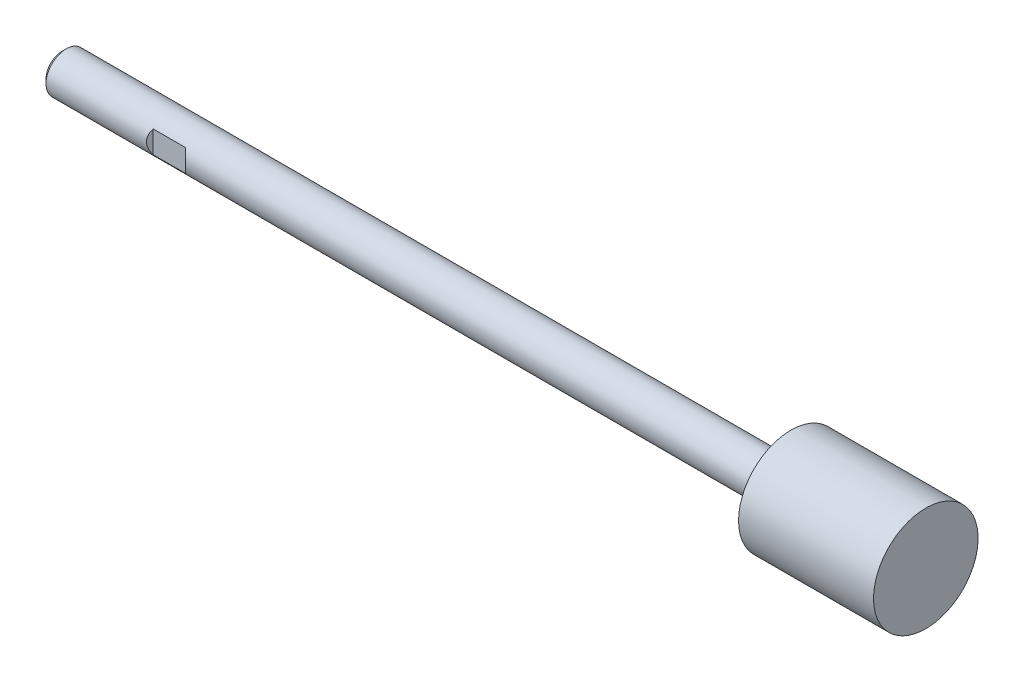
ISO-10303-21;
HEADER;
FILE_DESCRIPTION(('STEP AP214'),'2;1');
FILE_NAME('part.step','',(''),(''),'','','');
FILE_SCHEMA(('AUTOMOTIVE_DESIGN { 1 0 10303 214 1 1 1 1 }'));
ENDSEC;
DATA;
#1=APPLICATION_CONTEXT('core data for automotive mechanical design processes');
#2=APPLICATION_PROTOCOL_DEFINITION('international standard','automotive_design',2000,#1);
#3=PRODUCT_CONTEXT('',#1,'mechanical');
#4=PRODUCT('Part','Part','',(#3));
#5=PRODUCT_RELATED_PRODUCT_CATEGORY('part','',(#4));
#6=PRODUCT_DEFINITION_FORMATION('','',#4);
#7=PRODUCT_DEFINITION_CONTEXT('part definition',#1,'design');
#8=PRODUCT_DEFINITION('design','',#6,#7);
#9=PRODUCT_DEFINITION_SHAPE('','',#8);
#10=(LENGTH_UNIT() NAMED_UNIT(*) SI_UNIT(.MILLI.,.METRE.));
#11=(NAMED_UNIT(*) PLANE_ANGLE_UNIT() SI_UNIT($,.RADIAN.));
#12=(NAMED_UNIT(*) SI_UNIT($,.STERADIAN.) SOLID_ANGLE_UNIT());
#13=UNCERTAINTY_MEASURE_WITH_UNIT(LENGTH_MEASURE(1.E-05),#10,'distance_accuracy_value','');
#14=(GEOMETRIC_REPRESENTATION_CONTEXT(3) GLOBAL_UNCERTAINTY_ASSIGNED_CONTEXT((#13)) GLOBAL_UNIT_ASSIGNED_CONTEXT((#10,
#11,#12)) REPRESENTATION_CONTEXT('',''));
#15=CARTESIAN_POINT('',(0.,0.,0.));
#16=DIRECTION('',(0.,0.,1.));
#17=DIRECTION('',(1.,0.,0.));
#18=AXIS2_PLACEMENT_3D('',#15,#16,#17);
#19=CARTESIAN_POINT('',(0.,0.,0.));
#20=DIRECTION('',(1.,0.,0.));
#21=DIRECTION('',(0.,0.,-1.));
#22=AXIS2_PLACEMENT_3D('',#19,#20,#21);
#23=PLANE('',#22);
#24=CARTESIAN_POINT('',(0.,0.,0.));
#25=DIRECTION('',(-1.,0.,0.));
#26=DIRECTION('',(0.,0.,1.));
#27=AXIS2_PLACEMENT_3D('',#24,#25,#26);
#28=CIRCLE('',#27,2.3865);
#29=CARTESIAN_POINT('',(0.,0.,2.3865));
#30=VERTEX_POINT('',#29);
#31=EDGE_CURVE('E60',#30,#30,#28,.T.);
#32=ORIENTED_EDGE('',*,*,#31,.T.);
#33=EDGE_LOOP('',(#32));
#34=FACE_BOUND('',#33,.T.);
#35=ADVANCED_FACE('F16',(#34),#23,.F.);
#36=CARTESIAN_POINT('',(0.613499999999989,0.,0.));
#37=DIRECTION('',(1.,0.,0.));
#38=DIRECTION('',(0.,0.,-1.));
#39=AXIS2_PLACEMENT_3D('',#36,#37,#38);
#40=CONICAL_SURFACE('',#39,3.,0.785398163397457);
#41=ORIENTED_EDGE('',*,*,#31,.F.);
#42=EDGE_LOOP('',(#41));
#43=FACE_BOUND('',#42,.T.);
#44=CARTESIAN_POINT('',(0.613499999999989,0.,0.));
#45=DIRECTION('',(-1.,0.,0.));
#46=DIRECTION('',(0.,0.,1.));
#47=AXIS2_PLACEMENT_3D('',#44,#45,#46);
#48=CIRCLE('',#47,3.);
#49=CARTESIAN_POINT('',(0.613499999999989,0.,3.));
#50=VERTEX_POINT('',#49);
#51=EDGE_CURVE('E105',#50,#50,#48,.T.);
#52=ORIENTED_EDGE('',*,*,#51,.T.);
#53=EDGE_LOOP('',(#52));
#54=FACE_BOUND('',#53,.T.);
#55=ADVANCED_FACE('F111',(#43,#54),#40,.T.);
#56=CARTESIAN_POINT('',(128.,0.,0.));
#57=DIRECTION('',(-1.,0.,0.));
#58=DIRECTION('',(0.,0.,1.));
#59=AXIS2_PLACEMENT_3D('',#56,#57,#58);
#60=CYLINDRICAL_SURFACE('',#59,3.);
#61=DIRECTION('',(-1.,0.,0.));
#62=VECTOR('',#61,1.);
#63=CARTESIAN_POINT('',(128.,-1.6583123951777,-2.5));
#64=LINE('',#63,#62);
#65=CARTESIAN_POINT('',(16.,-1.65831239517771,-2.5));
#66=VERTEX_POINT('',#65);
#67=CARTESIAN_POINT('',(20.8,-1.6583123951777,-2.5));
#68=VERTEX_POINT('',#67);
#69=EDGE_CURVE('E81',#66,#68,#64,.F.);
#70=ORIENTED_EDGE('',*,*,#69,.T.);
#71=CARTESIAN_POINT('',(18.3,0.,0.));
#72=DIRECTION('',(0.707106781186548,0.,0.707106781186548));
#73=DIRECTION('',(-0.707106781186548,0.,0.707106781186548));
#74=AXIS2_PLACEMENT_3D('',#71,#72,#73);
#75=ELLIPSE('',#74,4.24264068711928,3.);
#76=CARTESIAN_POINT('',(20.8,1.6583123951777,-2.5));
#77=VERTEX_POINT('',#76);
#78=EDGE_CURVE('E11',#68,#77,#75,.T.);
#79=ORIENTED_EDGE('',*,*,#78,.T.);
#80=DIRECTION('',(-1.,0.,0.));
#81=VECTOR('',#80,1.);
#82=CARTESIAN_POINT('',(128.,1.6583123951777,-2.5));
#83=LINE('',#82,#81);
#84=CARTESIAN_POINT('',(16.,1.65831239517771,-2.5));
#85=VERTEX_POINT('',#84);
#86=EDGE_CURVE('E23',#77,#85,#83,.T.);
#87=ORIENTED_EDGE('',*,*,#86,.T.);
#88=CARTESIAN_POINT('',(18.5,0.,0.));
#89=DIRECTION('',(-0.707106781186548,0.,0.707106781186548));
#90=DIRECTION('',(-0.707106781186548,0.,-0.707106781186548));
#91=AXIS2_PLACEMENT_3D('',#88,#89,#90);
#92=ELLIPSE('',#91,4.24264068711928,3.);
#93=EDGE_CURVE('E78',#85,#66,#92,.T.);
#94=ORIENTED_EDGE('',*,*,#93,.T.);
#95=EDGE_LOOP('',(#70,#79,#87,#94));
#96=FACE_BOUND('',#95,.T.);
#97=DIRECTION('',(-1.,0.,0.));
#98=VECTOR('',#97,1.);
#99=CARTESIAN_POINT('',(128.,-1.6583123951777,2.5));
#100=LINE('',#99,#98);
#101=CARTESIAN_POINT('',(20.8,-1.65831239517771,2.5));
#102=VERTEX_POINT('',#101);
#103=CARTESIAN_POINT('',(16.,-1.6583123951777,2.5));
#104=VERTEX_POINT('',#103);
#105=EDGE_CURVE('E66',#102,#104,#100,.T.);
#106=ORIENTED_EDGE('',*,*,#105,.T.);
#107=CARTESIAN_POINT('',(18.5,0.,0.));
#108=DIRECTION('',(-0.707106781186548,0.,-0.707106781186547));
#109=DIRECTION('',(-0.707106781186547,0.,0.707106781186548));
#110=AXIS2_PLACEMENT_3D('',#107,#108,#109);
#111=ELLIPSE('',#110,4.24264068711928,3.);
#112=CARTESIAN_POINT('',(16.,1.6583123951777,2.5));
#113=VERTEX_POINT('',#112);
#114=EDGE_CURVE('E72',#104,#113,#111,.T.);
#115=ORIENTED_EDGE('',*,*,#114,.T.);
#116=DIRECTION('',(-1.,0.,0.));
#117=VECTOR('',#116,1.);
#118=CARTESIAN_POINT('',(128.,1.6583123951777,2.5));
#119=LINE('',#118,#117);
#120=CARTESIAN_POINT('',(20.8,1.65831239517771,2.5));
#121=VERTEX_POINT('',#120);
#122=EDGE_CURVE('E59',#113,#121,#119,.F.);
#123=ORIENTED_EDGE('',*,*,#122,.T.);
#124=CARTESIAN_POINT('',(18.3,0.,0.));
#125=DIRECTION('',(0.707106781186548,0.,-0.707106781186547));
#126=DIRECTION('',(-0.707106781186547,0.,-0.707106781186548));
#127=AXIS2_PLACEMENT_3D('',#124,#125,#126);
#128=ELLIPSE('',#127,4.24264068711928,3.);
#129=EDGE_CURVE('E54',#121,#102,#128,.T.);
#130=ORIENTED_EDGE('',*,*,#129,.T.);
#131=EDGE_LOOP('',(#106,#115,#123,#130));
#132=FACE_BOUND('',#131,.T.);
#133=ORIENTED_EDGE('',*,*,#51,.F.);
#134=EDGE_LOOP('',(#133));
#135=FACE_BOUND('',#134,.T.);
#136=CARTESIAN_POINT('',(108.,0.,0.));
#137=DIRECTION('',(-1.,0.,0.));
#138=DIRECTION('',(0.,0.,1.));
#139=AXIS2_PLACEMENT_3D('',#136,#137,#138);
#140=CIRCLE('',#139,3.);
#141=CARTESIAN_POINT('',(108.,0.,3.));
#142=VERTEX_POINT('',#141);
#143=EDGE_CURVE('E102',#142,#142,#140,.T.);
#144=ORIENTED_EDGE('',*,*,#143,.T.);
#145=EDGE_LOOP('',(#144));
#146=FACE_BOUND('',#145,.T.);
#147=ADVANCED_FACE('F70',(#96,#132,#135,#146),#60,.T.);
#148=CARTESIAN_POINT('',(108.,3.,0.));
#149=DIRECTION('',(1.,0.,0.));
#150=DIRECTION('',(0.,0.,-1.));
#151=AXIS2_PLACEMENT_3D('',#148,#149,#150);
#152=PLANE('',#151);
#153=ORIENTED_EDGE('',*,*,#143,.F.);
#154=EDGE_LOOP('',(#153));
#155=FACE_BOUND('',#154,.T.);
#156=CARTESIAN_POINT('',(108.,0.,0.));
#157=DIRECTION('',(-1.,0.,0.));
#158=DIRECTION('',(0.,0.,1.));
#159=AXIS2_PLACEMENT_3D('',#156,#157,#158);
#160=CIRCLE('',#159,7.75);
#161=CARTESIAN_POINT('',(108.,0.,7.75));
#162=VERTEX_POINT('',#161);
#163=EDGE_CURVE('E95',#162,#162,#160,.T.);
#164=ORIENTED_EDGE('',*,*,#163,.T.);
#165=EDGE_LOOP('',(#164));
#166=FACE_BOUND('',#165,.T.);
#167=ADVANCED_FACE('F117',(#155,#166),#152,.F.);
#168=CARTESIAN_POINT('',(128.,0.,0.));
#169=DIRECTION('',(-1.,0.,0.));
#170=DIRECTION('',(0.,0.,1.));
#171=AXIS2_PLACEMENT_3D('',#168,#169,#170);
#172=CYLINDRICAL_SURFACE('',#171,7.75);
#173=ORIENTED_EDGE('',*,*,#163,.F.);
#174=EDGE_LOOP('',(#173));
#175=FACE_BOUND('',#174,.T.);
#176=CARTESIAN_POINT('',(128.,0.,0.));
#177=DIRECTION('',(-1.,0.,0.));
#178=DIRECTION('',(0.,0.,1.));
#179=AXIS2_PLACEMENT_3D('',#176,#177,#178);
#180=CIRCLE('',#179,7.75);
#181=CARTESIAN_POINT('',(128.,0.,7.75));
#182=VERTEX_POINT('',#181);
#183=EDGE_CURVE('E92',#182,#182,#180,.T.);
#184=ORIENTED_EDGE('',*,*,#183,.T.);
#185=EDGE_LOOP('',(#184));
#186=FACE_BOUND('',#185,.T.);
#187=ADVANCED_FACE('F123',(#175,#186),#172,.T.);
#188=CARTESIAN_POINT('',(128.,7.75,0.));
#189=DIRECTION('',(-1.,0.,0.));
#190=DIRECTION('',(0.,0.,1.));
#191=AXIS2_PLACEMENT_3D('',#188,#189,#190);
#192=PLANE('',#191);
#193=ORIENTED_EDGE('',*,*,#183,.F.);
#194=EDGE_LOOP('',(#193));
#195=FACE_BOUND('',#194,.T.);
#196=ADVANCED_FACE('F129',(#195),#192,.F.);
#197=CARTESIAN_POINT('',(30.3,-2.5,12.));
#198=DIRECTION('',(0.707106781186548,0.,-0.707106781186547));
#199=DIRECTION('',(-0.707106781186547,0.,-0.707106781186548));
#200=AXIS2_PLACEMENT_3D('',#197,#198,#199);
#201=PLANE('',#200);
#202=DIRECTION('',(0.,1.,0.));
#203=VECTOR('',#202,1.);
#204=CARTESIAN_POINT('',(20.8,-2.5,2.5));
#205=LINE('',#204,#203);
#206=EDGE_CURVE('E36',#102,#121,#205,.T.);
#207=ORIENTED_EDGE('',*,*,#206,.F.);
#208=ORIENTED_EDGE('',*,*,#129,.F.);
#209=EDGE_LOOP('',(#207,#208));
#210=FACE_BOUND('',#209,.T.);
#211=ADVANCED_FACE('F55',(#210),#201,.F.);
#212=CARTESIAN_POINT('',(20.8,-2.5,2.5));
#213=DIRECTION('',(0.,0.,-1.));
#214=DIRECTION('',(-1.,0.,0.));
#215=AXIS2_PLACEMENT_3D('',#212,#213,#214);
#216=PLANE('',#215);
#217=ORIENTED_EDGE('',*,*,#206,.T.);
#218=ORIENTED_EDGE('',*,*,#122,.F.);
#219=DIRECTION('',(0.,1.,0.));
#220=VECTOR('',#219,1.);
#221=CARTESIAN_POINT('',(16.,-2.5,2.5));
#222=LINE('',#221,#220);
#223=EDGE_CURVE('E67',#104,#113,#222,.T.);
#224=ORIENTED_EDGE('',*,*,#223,.F.);
#225=ORIENTED_EDGE('',*,*,#105,.F.);
#226=EDGE_LOOP('',(#217,#218,#224,#225));
#227=FACE_BOUND('',#226,.T.);
#228=ADVANCED_FACE('F63',(#227),#216,.F.);
#229=CARTESIAN_POINT('',(16.,-2.5,2.5));
#230=DIRECTION('',(-0.707106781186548,0.,-0.707106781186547));
#231=DIRECTION('',(-0.707106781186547,0.,0.707106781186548));
#232=AXIS2_PLACEMENT_3D('',#229,#230,#231);
#233=PLANE('',#232);
#234=ORIENTED_EDGE('',*,*,#223,.T.);
#235=ORIENTED_EDGE('',*,*,#114,.F.);
#236=EDGE_LOOP('',(#234,#235));
#237=FACE_BOUND('',#236,.T.);
#238=ADVANCED_FACE('F194',(#237),#233,.F.);
#239=CARTESIAN_POINT('',(20.8,-2.5,-2.5));
#240=DIRECTION('',(0.707106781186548,0.,0.707106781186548));
#241=DIRECTION('',(0.707106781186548,0.,-0.707106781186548));
#242=AXIS2_PLACEMENT_3D('',#239,#240,#241);
#243=PLANE('',#242);
#244=DIRECTION('',(0.,1.,0.));
#245=VECTOR('',#244,1.);
#246=CARTESIAN_POINT('',(20.8,-2.5,-2.5));
#247=LINE('',#246,#245);
#248=EDGE_CURVE('E89',#68,#77,#247,.T.);
#249=ORIENTED_EDGE('',*,*,#248,.T.);
#250=ORIENTED_EDGE('',*,*,#78,.F.);
#251=EDGE_LOOP('',(#249,#250));
#252=FACE_BOUND('',#251,.T.);
#253=ADVANCED_FACE('F91',(#252),#243,.F.);
#254=CARTESIAN_POINT('',(16.,-2.5,-2.5));
#255=DIRECTION('',(0.,0.,1.));
#256=DIRECTION('',(1.,0.,0.));
#257=AXIS2_PLACEMENT_3D('',#254,#255,#256);
#258=PLANE('',#257);
#259=ORIENTED_EDGE('',*,*,#248,.F.);
#260=ORIENTED_EDGE('',*,*,#69,.F.);
#261=DIRECTION('',(0.,1.,0.));
#262=VECTOR('',#261,1.);
#263=CARTESIAN_POINT('',(16.,-2.5,-2.5));
#264=LINE('',#263,#262);
#265=EDGE_CURVE('E29',#66,#85,#264,.T.);
#266=ORIENTED_EDGE('',*,*,#265,.T.);
#267=ORIENTED_EDGE('',*,*,#86,.F.);
#268=EDGE_LOOP('',(#259,#260,#266,#267));
#269=FACE_BOUND('',#268,.T.);
#270=ADVANCED_FACE('F88',(#269),#258,.F.);
#271=CARTESIAN_POINT('',(14.4,-2.5,-4.1));
#272=DIRECTION('',(-0.707106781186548,0.,0.707106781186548));
#273=DIRECTION('',(0.707106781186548,0.,0.707106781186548));
#274=AXIS2_PLACEMENT_3D('',#271,#272,#273);
#275=PLANE('',#274);
#276=ORIENTED_EDGE('',*,*,#265,.F.);
#277=ORIENTED_EDGE('',*,*,#93,.F.);
#278=EDGE_LOOP('',(#276,#277));
#279=FACE_BOUND('',#278,.T.);
#280=ADVANCED_FACE('F223',(#279),#275,.F.);
#281=CLOSED_SHELL('',(#35,#55,#147,#167,#187,#196,#211,#228,#238,#253,#270,#280));
#282=MANIFOLD_SOLID_BREP('B1',#281);
#283=ADVANCED_BREP_SHAPE_REPRESENTATION('',(#18,#282),#14);
#284=SHAPE_DEFINITION_REPRESENTATION(#9,#283);
ENDSEC;
END-ISO-10303-21;
